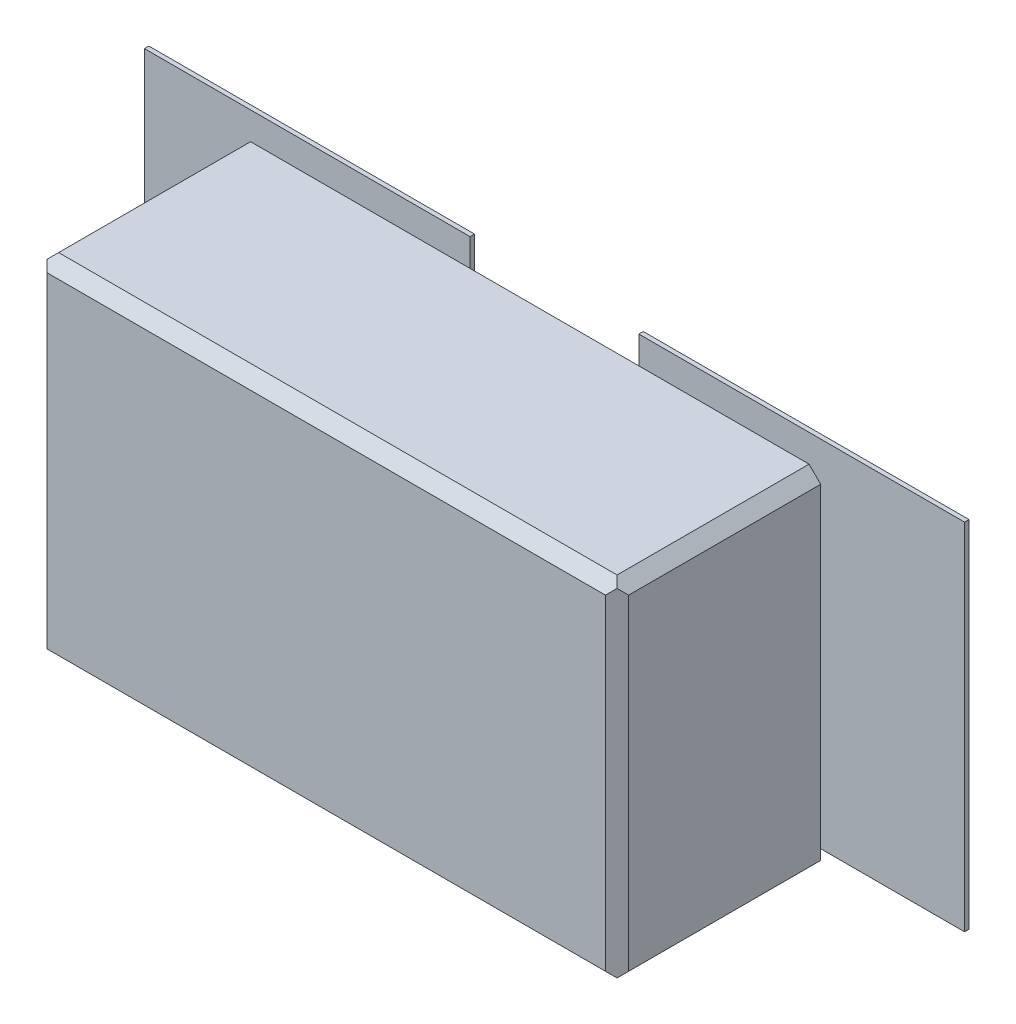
ISO-10303-21;
HEADER;
FILE_DESCRIPTION(('STEP AP214'),'2;1');
FILE_NAME('part.step','',(''),(''),'','','');
FILE_SCHEMA(('AUTOMOTIVE_DESIGN { 1 0 10303 214 1 1 1 1 }'));
ENDSEC;
DATA;
#1=APPLICATION_CONTEXT('core data for automotive mechanical design processes');
#2=APPLICATION_PROTOCOL_DEFINITION('international standard','automotive_design',2000,#1);
#3=PRODUCT_CONTEXT('',#1,'mechanical');
#4=PRODUCT('Part','Part','',(#3));
#5=PRODUCT_RELATED_PRODUCT_CATEGORY('part','',(#4));
#6=PRODUCT_DEFINITION_FORMATION('','',#4);
#7=PRODUCT_DEFINITION_CONTEXT('part definition',#1,'design');
#8=PRODUCT_DEFINITION('design','',#6,#7);
#9=PRODUCT_DEFINITION_SHAPE('','',#8);
#10=(LENGTH_UNIT() NAMED_UNIT(*) SI_UNIT(.MILLI.,.METRE.));
#11=(NAMED_UNIT(*) PLANE_ANGLE_UNIT() SI_UNIT($,.RADIAN.));
#12=(NAMED_UNIT(*) SI_UNIT($,.STERADIAN.) SOLID_ANGLE_UNIT());
#13=UNCERTAINTY_MEASURE_WITH_UNIT(LENGTH_MEASURE(1.E-05),#10,'distance_accuracy_value','');
#14=(GEOMETRIC_REPRESENTATION_CONTEXT(3) GLOBAL_UNCERTAINTY_ASSIGNED_CONTEXT((#13)) GLOBAL_UNIT_ASSIGNED_CONTEXT((#10,
#11,#12)) REPRESENTATION_CONTEXT('',''));
#15=CARTESIAN_POINT('',(0.,0.,0.));
#16=DIRECTION('',(0.,0.,1.));
#17=DIRECTION('',(1.,0.,0.));
#18=AXIS2_PLACEMENT_3D('',#15,#16,#17);
#19=CARTESIAN_POINT('',(0.,0.,0.08382));
#20=DIRECTION('',(0.,0.,1.));
#21=DIRECTION('',(1.,0.,0.));
#22=AXIS2_PLACEMENT_3D('',#19,#20,#21);
#23=PLANE('',#22);
#24=DIRECTION('',(0.,1.,0.));
#25=VECTOR('',#24,1.);
#26=CARTESIAN_POINT('',(0.145000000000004,0.30500000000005,0.08382));
#27=LINE('',#26,#25);
#28=CARTESIAN_POINT('',(0.145000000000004,-0.30500000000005,0.08382));
#29=VERTEX_POINT('',#28);
#30=CARTESIAN_POINT('',(0.145000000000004,0.30500000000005,0.08382));
#31=VERTEX_POINT('',#30);
#32=EDGE_CURVE('P0_E67',#29,#31,#27,.T.);
#33=ORIENTED_EDGE('',*,*,#32,.F.);
#34=DIRECTION('',(1.,0.,0.));
#35=VECTOR('',#34,1.);
#36=CARTESIAN_POINT('',(0.145000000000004,-0.30500000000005,0.08382));
#37=LINE('',#36,#35);
#38=CARTESIAN_POINT('',(0.704999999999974,-0.30500000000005,0.08382));
#39=VERTEX_POINT('',#38);
#40=EDGE_CURVE('P0_E19',#39,#29,#37,.F.);
#41=ORIENTED_EDGE('',*,*,#40,.F.);
#42=DIRECTION('',(0.,1.,0.));
#43=VECTOR('',#42,1.);
#44=CARTESIAN_POINT('',(0.704999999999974,-0.30500000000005,0.08382));
#45=LINE('',#44,#43);
#46=CARTESIAN_POINT('',(0.704999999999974,0.30500000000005,0.08382));
#47=VERTEX_POINT('',#46);
#48=EDGE_CURVE('P0_E57',#47,#39,#45,.F.);
#49=ORIENTED_EDGE('',*,*,#48,.F.);
#50=DIRECTION('',(1.,0.,0.));
#51=VECTOR('',#50,1.);
#52=CARTESIAN_POINT('',(0.704999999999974,0.30500000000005,0.08382));
#53=LINE('',#52,#51);
#54=EDGE_CURVE('P0_E52',#31,#47,#53,.T.);
#55=ORIENTED_EDGE('',*,*,#54,.F.);
#56=EDGE_LOOP('',(#33,#41,#49,#55));
#57=FACE_BOUND('',#56,.T.);
#58=ADVANCED_FACE('P0_F16',(#57),#23,.T.);
#59=CARTESIAN_POINT('',(0.145000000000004,-0.30500000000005,0.0762));
#60=DIRECTION('',(0.,-1.,0.));
#61=DIRECTION('',(0.,0.,-1.));
#62=AXIS2_PLACEMENT_3D('',#59,#60,#61);
#63=PLANE('',#62);
#64=DIRECTION('',(0.,0.,1.));
#65=VECTOR('',#64,1.);
#66=CARTESIAN_POINT('',(0.145000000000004,-0.30500000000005,0.0762));
#67=LINE('',#66,#65);
#68=CARTESIAN_POINT('',(0.145000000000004,-0.30500000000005,0.0762));
#69=VERTEX_POINT('',#68);
#70=EDGE_CURVE('P0_E78',#69,#29,#67,.T.);
#71=ORIENTED_EDGE('',*,*,#70,.F.);
#72=DIRECTION('',(1.,0.,0.));
#73=VECTOR('',#72,1.);
#74=CARTESIAN_POINT('',(0.,-0.30500000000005,0.0762));
#75=LINE('',#74,#73);
#76=CARTESIAN_POINT('',(0.704999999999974,-0.30500000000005,0.0762));
#77=VERTEX_POINT('',#76);
#78=EDGE_CURVE('P0_E73',#69,#77,#75,.T.);
#79=ORIENTED_EDGE('',*,*,#78,.T.);
#80=DIRECTION('',(0.,0.,-1.));
#81=VECTOR('',#80,1.);
#82=CARTESIAN_POINT('',(0.704999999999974,-0.30500000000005,0.0762));
#83=LINE('',#82,#81);
#84=EDGE_CURVE('P0_E62',#39,#77,#83,.T.);
#85=ORIENTED_EDGE('',*,*,#84,.F.);
#86=ORIENTED_EDGE('',*,*,#40,.T.);
#87=EDGE_LOOP('',(#71,#79,#85,#86));
#88=FACE_BOUND('',#87,.T.);
#89=ADVANCED_FACE('P0_F72',(#88),#63,.T.);
#90=CARTESIAN_POINT('',(0.704999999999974,-0.30500000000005,0.0762));
#91=DIRECTION('',(1.,0.,0.));
#92=DIRECTION('',(0.,0.,-1.));
#93=AXIS2_PLACEMENT_3D('',#90,#91,#92);
#94=PLANE('',#93);
#95=ORIENTED_EDGE('',*,*,#84,.T.);
#96=DIRECTION('',(0.,1.,0.));
#97=VECTOR('',#96,1.);
#98=CARTESIAN_POINT('',(0.704999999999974,0.,0.0762));
#99=LINE('',#98,#97);
#100=CARTESIAN_POINT('',(0.704999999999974,0.30500000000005,0.0762));
#101=VERTEX_POINT('',#100);
#102=EDGE_CURVE('P0_E83',#77,#101,#99,.T.);
#103=ORIENTED_EDGE('',*,*,#102,.T.);
#104=DIRECTION('',(0.,0.,1.));
#105=VECTOR('',#104,1.);
#106=CARTESIAN_POINT('',(0.704999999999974,0.30500000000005,0.0762));
#107=LINE('',#106,#105);
#108=EDGE_CURVE('P0_E64',#47,#101,#107,.F.);
#109=ORIENTED_EDGE('',*,*,#108,.F.);
#110=ORIENTED_EDGE('',*,*,#48,.T.);
#111=EDGE_LOOP('',(#95,#103,#109,#110));
#112=FACE_BOUND('',#111,.T.);
#113=ADVANCED_FACE('P0_F59',(#112),#94,.T.);
#114=CARTESIAN_POINT('',(0.704999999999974,0.30500000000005,0.0762));
#115=DIRECTION('',(0.,1.,0.));
#116=DIRECTION('',(0.,0.,1.));
#117=AXIS2_PLACEMENT_3D('',#114,#115,#116);
#118=PLANE('',#117);
#119=ORIENTED_EDGE('',*,*,#108,.T.);
#120=DIRECTION('',(1.,0.,0.));
#121=VECTOR('',#120,1.);
#122=CARTESIAN_POINT('',(0.,0.30500000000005,0.0762));
#123=LINE('',#122,#121);
#124=CARTESIAN_POINT('',(0.145000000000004,0.30500000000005,0.0762));
#125=VERTEX_POINT('',#124);
#126=EDGE_CURVE('P0_E25',#101,#125,#123,.F.);
#127=ORIENTED_EDGE('',*,*,#126,.T.);
#128=DIRECTION('',(0.,0.,1.));
#129=VECTOR('',#128,1.);
#130=CARTESIAN_POINT('',(0.145000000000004,0.30500000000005,0.0762));
#131=LINE('',#130,#129);
#132=EDGE_CURVE('P0_E33',#31,#125,#131,.F.);
#133=ORIENTED_EDGE('',*,*,#132,.F.);
#134=ORIENTED_EDGE('',*,*,#54,.T.);
#135=EDGE_LOOP('',(#119,#127,#133,#134));
#136=FACE_BOUND('',#135,.T.);
#137=ADVANCED_FACE('P0_F87',(#136),#118,.T.);
#138=CARTESIAN_POINT('',(0.145000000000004,0.30500000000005,0.0762));
#139=DIRECTION('',(-1.,0.,0.));
#140=DIRECTION('',(0.,0.,1.));
#141=AXIS2_PLACEMENT_3D('',#138,#139,#140);
#142=PLANE('',#141);
#143=ORIENTED_EDGE('',*,*,#132,.T.);
#144=DIRECTION('',(0.,1.,0.));
#145=VECTOR('',#144,1.);
#146=CARTESIAN_POINT('',(0.145000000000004,0.,0.0762));
#147=LINE('',#146,#145);
#148=EDGE_CURVE('P0_E11',#125,#69,#147,.F.);
#149=ORIENTED_EDGE('',*,*,#148,.T.);
#150=ORIENTED_EDGE('',*,*,#70,.T.);
#151=ORIENTED_EDGE('',*,*,#32,.T.);
#152=EDGE_LOOP('',(#143,#149,#150,#151));
#153=FACE_BOUND('',#152,.T.);
#154=ADVANCED_FACE('P0_F90',(#153),#142,.T.);
#155=CARTESIAN_POINT('',(0.,0.,0.0762));
#156=DIRECTION('',(0.,0.,1.));
#157=DIRECTION('',(1.,0.,0.));
#158=AXIS2_PLACEMENT_3D('',#155,#156,#157);
#159=PLANE('',#158);
#160=ORIENTED_EDGE('',*,*,#126,.F.);
#161=ORIENTED_EDGE('',*,*,#102,.F.);
#162=ORIENTED_EDGE('',*,*,#78,.F.);
#163=ORIENTED_EDGE('',*,*,#148,.F.);
#164=EDGE_LOOP('',(#160,#161,#162,#163));
#165=FACE_BOUND('',#164,.T.);
#166=ADVANCED_FACE('P0_F89',(#165),#159,.F.);
#167=CLOSED_SHELL('',(#58,#89,#113,#137,#154,#166));
#168=MANIFOLD_SOLID_BREP('P0_B1',#167);
#169=CARTESIAN_POINT('',(0.,0.,0.08382));
#170=DIRECTION('',(0.,0.,1.));
#171=DIRECTION('',(1.,0.,0.));
#172=AXIS2_PLACEMENT_3D('',#169,#170,#171);
#173=PLANE('',#172);
#174=DIRECTION('',(0.,1.,0.));
#175=VECTOR('',#174,1.);
#176=CARTESIAN_POINT('',(-0.704999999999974,0.30500000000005,0.08382));
#177=LINE('',#176,#175);
#178=CARTESIAN_POINT('',(-0.704999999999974,-0.30500000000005,0.08382));
#179=VERTEX_POINT('',#178);
#180=CARTESIAN_POINT('',(-0.704999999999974,0.30500000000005,0.08382));
#181=VERTEX_POINT('',#180);
#182=EDGE_CURVE('P1_E67',#179,#181,#177,.T.);
#183=ORIENTED_EDGE('',*,*,#182,.F.);
#184=DIRECTION('',(1.,0.,0.));
#185=VECTOR('',#184,1.);
#186=CARTESIAN_POINT('',(-0.704999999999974,-0.30500000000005,0.08382));
#187=LINE('',#186,#185);
#188=CARTESIAN_POINT('',(-0.145000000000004,-0.30500000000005,0.08382));
#189=VERTEX_POINT('',#188);
#190=EDGE_CURVE('P1_E19',#189,#179,#187,.F.);
#191=ORIENTED_EDGE('',*,*,#190,.F.);
#192=DIRECTION('',(0.,1.,0.));
#193=VECTOR('',#192,1.);
#194=CARTESIAN_POINT('',(-0.145000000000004,-0.30500000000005,0.08382));
#195=LINE('',#194,#193);
#196=CARTESIAN_POINT('',(-0.145000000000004,0.30500000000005,0.08382));
#197=VERTEX_POINT('',#196);
#198=EDGE_CURVE('P1_E57',#197,#189,#195,.F.);
#199=ORIENTED_EDGE('',*,*,#198,.F.);
#200=DIRECTION('',(1.,0.,0.));
#201=VECTOR('',#200,1.);
#202=CARTESIAN_POINT('',(-0.145000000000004,0.30500000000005,0.08382));
#203=LINE('',#202,#201);
#204=EDGE_CURVE('P1_E52',#181,#197,#203,.T.);
#205=ORIENTED_EDGE('',*,*,#204,.F.);
#206=EDGE_LOOP('',(#183,#191,#199,#205));
#207=FACE_BOUND('',#206,.T.);
#208=ADVANCED_FACE('P1_F16',(#207),#173,.T.);
#209=CARTESIAN_POINT('',(-0.704999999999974,-0.30500000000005,0.0762));
#210=DIRECTION('',(0.,-1.,0.));
#211=DIRECTION('',(0.,0.,-1.));
#212=AXIS2_PLACEMENT_3D('',#209,#210,#211);
#213=PLANE('',#212);
#214=DIRECTION('',(0.,0.,1.));
#215=VECTOR('',#214,1.);
#216=CARTESIAN_POINT('',(-0.704999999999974,-0.30500000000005,0.0762));
#217=LINE('',#216,#215);
#218=CARTESIAN_POINT('',(-0.704999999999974,-0.30500000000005,0.0762));
#219=VERTEX_POINT('',#218);
#220=EDGE_CURVE('P1_E78',#219,#179,#217,.T.);
#221=ORIENTED_EDGE('',*,*,#220,.F.);
#222=DIRECTION('',(1.,0.,0.));
#223=VECTOR('',#222,1.);
#224=CARTESIAN_POINT('',(0.,-0.30500000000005,0.0762));
#225=LINE('',#224,#223);
#226=CARTESIAN_POINT('',(-0.145000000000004,-0.30500000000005,0.0762));
#227=VERTEX_POINT('',#226);
#228=EDGE_CURVE('P1_E73',#219,#227,#225,.T.);
#229=ORIENTED_EDGE('',*,*,#228,.T.);
#230=DIRECTION('',(0.,0.,-1.));
#231=VECTOR('',#230,1.);
#232=CARTESIAN_POINT('',(-0.145000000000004,-0.30500000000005,0.0762));
#233=LINE('',#232,#231);
#234=EDGE_CURVE('P1_E62',#189,#227,#233,.T.);
#235=ORIENTED_EDGE('',*,*,#234,.F.);
#236=ORIENTED_EDGE('',*,*,#190,.T.);
#237=EDGE_LOOP('',(#221,#229,#235,#236));
#238=FACE_BOUND('',#237,.T.);
#239=ADVANCED_FACE('P1_F72',(#238),#213,.T.);
#240=CARTESIAN_POINT('',(-0.145000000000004,-0.30500000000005,0.0762));
#241=DIRECTION('',(1.,0.,0.));
#242=DIRECTION('',(0.,0.,-1.));
#243=AXIS2_PLACEMENT_3D('',#240,#241,#242);
#244=PLANE('',#243);
#245=ORIENTED_EDGE('',*,*,#234,.T.);
#246=DIRECTION('',(0.,1.,0.));
#247=VECTOR('',#246,1.);
#248=CARTESIAN_POINT('',(-0.145000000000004,0.,0.0762));
#249=LINE('',#248,#247);
#250=CARTESIAN_POINT('',(-0.145000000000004,0.30500000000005,0.0762));
#251=VERTEX_POINT('',#250);
#252=EDGE_CURVE('P1_E83',#227,#251,#249,.T.);
#253=ORIENTED_EDGE('',*,*,#252,.T.);
#254=DIRECTION('',(0.,0.,1.));
#255=VECTOR('',#254,1.);
#256=CARTESIAN_POINT('',(-0.145000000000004,0.30500000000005,0.0762));
#257=LINE('',#256,#255);
#258=EDGE_CURVE('P1_E64',#197,#251,#257,.F.);
#259=ORIENTED_EDGE('',*,*,#258,.F.);
#260=ORIENTED_EDGE('',*,*,#198,.T.);
#261=EDGE_LOOP('',(#245,#253,#259,#260));
#262=FACE_BOUND('',#261,.T.);
#263=ADVANCED_FACE('P1_F59',(#262),#244,.T.);
#264=CARTESIAN_POINT('',(-0.145000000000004,0.30500000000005,0.0762));
#265=DIRECTION('',(0.,1.,0.));
#266=DIRECTION('',(0.,0.,1.));
#267=AXIS2_PLACEMENT_3D('',#264,#265,#266);
#268=PLANE('',#267);
#269=ORIENTED_EDGE('',*,*,#258,.T.);
#270=DIRECTION('',(1.,0.,0.));
#271=VECTOR('',#270,1.);
#272=CARTESIAN_POINT('',(0.,0.30500000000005,0.0762));
#273=LINE('',#272,#271);
#274=CARTESIAN_POINT('',(-0.704999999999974,0.30500000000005,0.0762));
#275=VERTEX_POINT('',#274);
#276=EDGE_CURVE('P1_E25',#251,#275,#273,.F.);
#277=ORIENTED_EDGE('',*,*,#276,.T.);
#278=DIRECTION('',(0.,0.,1.));
#279=VECTOR('',#278,1.);
#280=CARTESIAN_POINT('',(-0.704999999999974,0.30500000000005,0.0762));
#281=LINE('',#280,#279);
#282=EDGE_CURVE('P1_E33',#181,#275,#281,.F.);
#283=ORIENTED_EDGE('',*,*,#282,.F.);
#284=ORIENTED_EDGE('',*,*,#204,.T.);
#285=EDGE_LOOP('',(#269,#277,#283,#284));
#286=FACE_BOUND('',#285,.T.);
#287=ADVANCED_FACE('P1_F87',(#286),#268,.T.);
#288=CARTESIAN_POINT('',(-0.704999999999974,0.30500000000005,0.0762));
#289=DIRECTION('',(-1.,0.,0.));
#290=DIRECTION('',(0.,0.,1.));
#291=AXIS2_PLACEMENT_3D('',#288,#289,#290);
#292=PLANE('',#291);
#293=ORIENTED_EDGE('',*,*,#282,.T.);
#294=DIRECTION('',(0.,1.,0.));
#295=VECTOR('',#294,1.);
#296=CARTESIAN_POINT('',(-0.704999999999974,0.,0.0762));
#297=LINE('',#296,#295);
#298=EDGE_CURVE('P1_E11',#275,#219,#297,.F.);
#299=ORIENTED_EDGE('',*,*,#298,.T.);
#300=ORIENTED_EDGE('',*,*,#220,.T.);
#301=ORIENTED_EDGE('',*,*,#182,.T.);
#302=EDGE_LOOP('',(#293,#299,#300,#301));
#303=FACE_BOUND('',#302,.T.);
#304=ADVANCED_FACE('P1_F90',(#303),#292,.T.);
#305=CARTESIAN_POINT('',(0.,0.,0.0762));
#306=DIRECTION('',(0.,0.,1.));
#307=DIRECTION('',(1.,0.,0.));
#308=AXIS2_PLACEMENT_3D('',#305,#306,#307);
#309=PLANE('',#308);
#310=ORIENTED_EDGE('',*,*,#276,.F.);
#311=ORIENTED_EDGE('',*,*,#252,.F.);
#312=ORIENTED_EDGE('',*,*,#228,.F.);
#313=ORIENTED_EDGE('',*,*,#298,.F.);
#314=EDGE_LOOP('',(#310,#311,#312,#313));
#315=FACE_BOUND('',#314,.T.);
#316=ADVANCED_FACE('P1_F89',(#315),#309,.F.);
#317=CLOSED_SHELL('',(#208,#239,#263,#287,#304,#316));
#318=MANIFOLD_SOLID_BREP('P1_B1',#317);
#319=CARTESIAN_POINT('',(0.,0.,0.0862000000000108));
#320=DIRECTION('',(0.,0.,-1.));
#321=DIRECTION('',(-1.,0.,0.));
#322=AXIS2_PLACEMENT_3D('',#319,#320,#321);
#323=PLANE('',#322);
#324=DIRECTION('',(1.,0.,0.));
#325=VECTOR('',#324,1.);
#326=CARTESIAN_POINT('',(-0.415997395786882,0.249999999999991,0.0862000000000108));
#327=LINE('',#326,#325);
#328=CARTESIAN_POINT('',(-0.215997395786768,0.249999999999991,0.0862000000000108));
#329=VERTEX_POINT('',#328);
#330=CARTESIAN_POINT('',(-0.41599739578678,0.249999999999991,0.0862000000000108));
#331=VERTEX_POINT('',#330);
#332=EDGE_CURVE('P2_E183',#329,#331,#327,.F.);
#333=ORIENTED_EDGE('',*,*,#332,.F.);
#334=DIRECTION('',(0.,1.,0.));
#335=VECTOR('',#334,1.);
#336=CARTESIAN_POINT('',(-0.215997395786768,0.249999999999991,0.0862000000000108));
#337=LINE('',#336,#335);
#338=CARTESIAN_POINT('',(-0.215997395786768,-0.249999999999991,0.0862000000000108));
#339=VERTEX_POINT('',#338);
#340=EDGE_CURVE('P2_E211',#339,#329,#337,.T.);
#341=ORIENTED_EDGE('',*,*,#340,.F.);
#342=DIRECTION('',(1.,0.,0.));
#343=VECTOR('',#342,1.);
#344=CARTESIAN_POINT('',(-0.215997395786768,-0.249999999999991,0.0862000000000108));
#345=LINE('',#344,#343);
#346=CARTESIAN_POINT('',(-0.465997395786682,-0.249999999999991,0.0862000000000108));
#347=VERTEX_POINT('',#346);
#348=EDGE_CURVE('P2_E162',#347,#339,#345,.T.);
#349=ORIENTED_EDGE('',*,*,#348,.F.);
#350=DIRECTION('',(0.,1.,0.));
#351=VECTOR('',#350,1.);
#352=CARTESIAN_POINT('',(-0.465997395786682,-0.249999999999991,0.0862000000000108));
#353=LINE('',#352,#351);
#354=CARTESIAN_POINT('',(-0.465997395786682,0.199999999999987,0.0862000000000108));
#355=VERTEX_POINT('',#354);
#356=EDGE_CURVE('P2_E156',#355,#347,#353,.F.);
#357=ORIENTED_EDGE('',*,*,#356,.F.);
#358=CARTESIAN_POINT('',(-0.465997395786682,0.249999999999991,0.0862000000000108));
#359=DIRECTION('',(0.,0.,-1.));
#360=DIRECTION('',(-1.,0.,0.));
#361=AXIS2_PLACEMENT_3D('',#358,#359,#360);
#362=CIRCLE('',#361,0.0500000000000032);
#363=EDGE_CURVE('P2_E19',#355,#331,#362,.F.);
#364=ORIENTED_EDGE('',*,*,#363,.T.);
#365=EDGE_LOOP('',(#333,#341,#349,#357,#364));
#366=FACE_BOUND('',#365,.T.);
#367=ADVANCED_FACE('P2_F16',(#366),#323,.T.);
#368=CARTESIAN_POINT('',(0.,0.,0.0862000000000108));
#369=DIRECTION('',(0.,0.,-1.));
#370=DIRECTION('',(-1.,0.,0.));
#371=AXIS2_PLACEMENT_3D('',#368,#369,#370);
#372=PLANE('',#371);
#373=DIRECTION('',(1.,0.,0.));
#374=VECTOR('',#373,1.);
#375=CARTESIAN_POINT('',(0.184002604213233,0.249999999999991,0.0862000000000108));
#376=LINE('',#375,#374);
#377=CARTESIAN_POINT('',(0.434002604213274,0.249999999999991,0.0862000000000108));
#378=VERTEX_POINT('',#377);
#379=CARTESIAN_POINT('',(0.184002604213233,0.249999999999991,0.0862000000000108));
#380=VERTEX_POINT('',#379);
#381=EDGE_CURVE('P2_E231',#378,#380,#376,.F.);
#382=ORIENTED_EDGE('',*,*,#381,.F.);
#383=DIRECTION('',(0.,1.,0.));
#384=VECTOR('',#383,1.);
#385=CARTESIAN_POINT('',(0.434002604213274,0.249999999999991,0.0862000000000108));
#386=LINE('',#385,#384);
#387=CARTESIAN_POINT('',(0.434002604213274,-0.249999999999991,0.0862000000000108));
#388=VERTEX_POINT('',#387);
#389=EDGE_CURVE('P2_E248',#388,#378,#386,.T.);
#390=ORIENTED_EDGE('',*,*,#389,.F.);
#391=DIRECTION('',(1.,0.,0.));
#392=VECTOR('',#391,1.);
#393=CARTESIAN_POINT('',(0.434002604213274,-0.249999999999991,0.0862000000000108));
#394=LINE('',#393,#392);
#395=CARTESIAN_POINT('',(0.184002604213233,-0.249999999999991,0.0862000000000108));
#396=VERTEX_POINT('',#395);
#397=EDGE_CURVE('P2_E246',#396,#388,#394,.T.);
#398=ORIENTED_EDGE('',*,*,#397,.F.);
#399=DIRECTION('',(0.,1.,0.));
#400=VECTOR('',#399,1.);
#401=CARTESIAN_POINT('',(0.184002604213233,-0.249999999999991,0.0862000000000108));
#402=LINE('',#401,#400);
#403=EDGE_CURVE('P2_E240',#380,#396,#402,.F.);
#404=ORIENTED_EDGE('',*,*,#403,.F.);
#405=EDGE_LOOP('',(#382,#390,#398,#404));
#406=FACE_BOUND('',#405,.T.);
#407=ADVANCED_FACE('P2_F272',(#406),#372,.T.);
#408=CARTESIAN_POINT('',(-0.215997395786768,0.249999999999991,0.126200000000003));
#409=DIRECTION('',(1.,0.,0.));
#410=DIRECTION('',(0.,0.,-1.));
#411=AXIS2_PLACEMENT_3D('',#408,#409,#410);
#412=PLANE('',#411);
#413=DIRECTION('',(0.,0.,1.));
#414=VECTOR('',#413,1.);
#415=CARTESIAN_POINT('',(-0.215997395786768,0.249999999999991,0.126200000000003));
#416=LINE('',#415,#414);
#417=CARTESIAN_POINT('',(-0.215997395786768,0.249999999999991,0.126200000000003));
#418=VERTEX_POINT('',#417);
#419=EDGE_CURVE('P2_E181',#418,#329,#416,.F.);
#420=ORIENTED_EDGE('',*,*,#419,.F.);
#421=DIRECTION('',(0.,1.,0.));
#422=VECTOR('',#421,1.);
#423=CARTESIAN_POINT('',(-0.215997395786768,0.,0.126200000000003));
#424=LINE('',#423,#422);
#425=CARTESIAN_POINT('',(-0.215997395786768,-0.249999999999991,0.126200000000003));
#426=VERTEX_POINT('',#425);
#427=EDGE_CURVE('P2_E193',#418,#426,#424,.F.);
#428=ORIENTED_EDGE('',*,*,#427,.T.);
#429=DIRECTION('',(0.,0.,-1.));
#430=VECTOR('',#429,1.);
#431=CARTESIAN_POINT('',(-0.215997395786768,-0.249999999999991,0.126200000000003));
#432=LINE('',#431,#430);
#433=EDGE_CURVE('P2_E167',#339,#426,#432,.F.);
#434=ORIENTED_EDGE('',*,*,#433,.F.);
#435=ORIENTED_EDGE('',*,*,#340,.T.);
#436=EDGE_LOOP('',(#420,#428,#434,#435));
#437=FACE_BOUND('',#436,.T.);
#438=ADVANCED_FACE('P2_F261',(#437),#412,.T.);
#439=CARTESIAN_POINT('',(-0.215997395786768,-0.249999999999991,0.126200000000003));
#440=DIRECTION('',(0.,-1.,0.));
#441=DIRECTION('',(0.,0.,-1.));
#442=AXIS2_PLACEMENT_3D('',#439,#440,#441);
#443=PLANE('',#442);
#444=ORIENTED_EDGE('',*,*,#433,.T.);
#445=DIRECTION('',(1.,0.,0.));
#446=VECTOR('',#445,1.);
#447=CARTESIAN_POINT('',(0.,-0.249999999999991,0.126200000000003));
#448=LINE('',#447,#446);
#449=CARTESIAN_POINT('',(-0.465997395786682,-0.249999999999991,0.126200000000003));
#450=VERTEX_POINT('',#449);
#451=EDGE_CURVE('P2_E195',#426,#450,#448,.F.);
#452=ORIENTED_EDGE('',*,*,#451,.T.);
#453=DIRECTION('',(0.,0.,1.));
#454=VECTOR('',#453,1.);
#455=CARTESIAN_POINT('',(-0.465997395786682,-0.249999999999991,0.126200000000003));
#456=LINE('',#455,#454);
#457=EDGE_CURVE('P2_E166',#347,#450,#456,.T.);
#458=ORIENTED_EDGE('',*,*,#457,.F.);
#459=ORIENTED_EDGE('',*,*,#348,.T.);
#460=EDGE_LOOP('',(#444,#452,#458,#459));
#461=FACE_BOUND('',#460,.T.);
#462=ADVANCED_FACE('P2_F263',(#461),#443,.T.);
#463=CARTESIAN_POINT('',(-0.465997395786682,-0.249999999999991,0.126200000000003));
#464=DIRECTION('',(-1.,0.,0.));
#465=DIRECTION('',(0.,0.,1.));
#466=AXIS2_PLACEMENT_3D('',#463,#464,#465);
#467=PLANE('',#466);
#468=ORIENTED_EDGE('',*,*,#457,.T.);
#469=DIRECTION('',(0.,1.,0.));
#470=VECTOR('',#469,1.);
#471=CARTESIAN_POINT('',(-0.465997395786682,0.,0.126200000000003));
#472=LINE('',#471,#470);
#473=CARTESIAN_POINT('',(-0.465997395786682,0.199999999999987,0.126200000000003));
#474=VERTEX_POINT('',#473);
#475=EDGE_CURVE('P2_E173',#450,#474,#472,.T.);
#476=ORIENTED_EDGE('',*,*,#475,.T.);
#477=DIRECTION('',(0.,0.,-1.));
#478=VECTOR('',#477,1.);
#479=CARTESIAN_POINT('',(-0.465997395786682,0.199999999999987,0.126200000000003));
#480=LINE('',#479,#478);
#481=EDGE_CURVE('P2_E170',#474,#355,#480,.T.);
#482=ORIENTED_EDGE('',*,*,#481,.T.);
#483=ORIENTED_EDGE('',*,*,#356,.T.);
#484=EDGE_LOOP('',(#468,#476,#482,#483));
#485=FACE_BOUND('',#484,.T.);
#486=ADVANCED_FACE('P2_F171',(#485),#467,.T.);
#487=CARTESIAN_POINT('',(-0.465997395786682,0.249999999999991,0.126200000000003));
#488=DIRECTION('',(0.,0.,-1.));
#489=DIRECTION('',(-1.,0.,0.));
#490=AXIS2_PLACEMENT_3D('',#487,#488,#489);
#491=CYLINDRICAL_SURFACE('',#490,0.0500000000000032);
#492=ORIENTED_EDGE('',*,*,#363,.F.);
#493=ORIENTED_EDGE('',*,*,#481,.F.);
#494=CARTESIAN_POINT('',(-0.465997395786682,0.249999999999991,0.126200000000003));
#495=DIRECTION('',(0.,0.,-1.));
#496=DIRECTION('',(-1.,0.,0.));
#497=AXIS2_PLACEMENT_3D('',#494,#495,#496);
#498=CIRCLE('',#497,0.0500000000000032);
#499=CARTESIAN_POINT('',(-0.41599739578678,0.249999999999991,0.126200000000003));
#500=VERTEX_POINT('',#499);
#501=EDGE_CURVE('P2_E219',#474,#500,#498,.F.);
#502=ORIENTED_EDGE('',*,*,#501,.T.);
#503=DIRECTION('',(0.,0.,1.));
#504=VECTOR('',#503,1.);
#505=CARTESIAN_POINT('',(-0.415997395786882,0.249999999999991,0.126200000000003));
#506=LINE('',#505,#504);
#507=EDGE_CURVE('P2_E179',#331,#500,#506,.T.);
#508=ORIENTED_EDGE('',*,*,#507,.F.);
#509=EDGE_LOOP('',(#492,#493,#502,#508));
#510=FACE_BOUND('',#509,.T.);
#511=ADVANCED_FACE('P2_F177',(#510),#491,.F.);
#512=CARTESIAN_POINT('',(-0.415997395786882,0.249999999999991,0.126200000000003));
#513=DIRECTION('',(0.,1.,0.));
#514=DIRECTION('',(0.,0.,1.));
#515=AXIS2_PLACEMENT_3D('',#512,#513,#514);
#516=PLANE('',#515);
#517=ORIENTED_EDGE('',*,*,#507,.T.);
#518=DIRECTION('',(1.,0.,0.));
#519=VECTOR('',#518,1.);
#520=CARTESIAN_POINT('',(0.,0.249999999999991,0.126200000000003));
#521=LINE('',#520,#519);
#522=EDGE_CURVE('P2_E220',#500,#418,#521,.T.);
#523=ORIENTED_EDGE('',*,*,#522,.T.);
#524=ORIENTED_EDGE('',*,*,#419,.T.);
#525=ORIENTED_EDGE('',*,*,#332,.T.);
#526=EDGE_LOOP('',(#517,#523,#524,#525));
#527=FACE_BOUND('',#526,.T.);
#528=ADVANCED_FACE('P2_F253',(#527),#516,.T.);
#529=CARTESIAN_POINT('',(0.434002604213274,0.249999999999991,0.126200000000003));
#530=DIRECTION('',(1.,0.,0.));
#531=DIRECTION('',(0.,0.,-1.));
#532=AXIS2_PLACEMENT_3D('',#529,#530,#531);
#533=PLANE('',#532);
#534=DIRECTION('',(0.,0.,1.));
#535=VECTOR('',#534,1.);
#536=CARTESIAN_POINT('',(0.434002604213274,0.249999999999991,0.126200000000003));
#537=LINE('',#536,#535);
#538=CARTESIAN_POINT('',(0.434002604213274,0.249999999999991,0.126200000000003));
#539=VERTEX_POINT('',#538);
#540=EDGE_CURVE('P2_E234',#539,#378,#537,.F.);
#541=ORIENTED_EDGE('',*,*,#540,.F.);
#542=DIRECTION('',(0.,1.,0.));
#543=VECTOR('',#542,1.);
#544=CARTESIAN_POINT('',(0.434002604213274,0.,0.126200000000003));
#545=LINE('',#544,#543);
#546=CARTESIAN_POINT('',(0.434002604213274,-0.249999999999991,0.126200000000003));
#547=VERTEX_POINT('',#546);
#548=EDGE_CURVE('P2_E221',#539,#547,#545,.F.);
#549=ORIENTED_EDGE('',*,*,#548,.T.);
#550=DIRECTION('',(0.,0.,-1.));
#551=VECTOR('',#550,1.);
#552=CARTESIAN_POINT('',(0.434002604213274,-0.249999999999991,0.126200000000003));
#553=LINE('',#552,#551);
#554=EDGE_CURVE('P2_E243',#388,#547,#553,.F.);
#555=ORIENTED_EDGE('',*,*,#554,.F.);
#556=ORIENTED_EDGE('',*,*,#389,.T.);
#557=EDGE_LOOP('',(#541,#549,#555,#556));
#558=FACE_BOUND('',#557,.T.);
#559=ADVANCED_FACE('P2_F343',(#558),#533,.T.);
#560=CARTESIAN_POINT('',(0.434002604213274,-0.249999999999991,0.126200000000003));
#561=DIRECTION('',(0.,-1.,0.));
#562=DIRECTION('',(0.,0.,-1.));
#563=AXIS2_PLACEMENT_3D('',#560,#561,#562);
#564=PLANE('',#563);
#565=ORIENTED_EDGE('',*,*,#554,.T.);
#566=DIRECTION('',(1.,0.,0.));
#567=VECTOR('',#566,1.);
#568=CARTESIAN_POINT('',(0.,-0.249999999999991,0.126200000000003));
#569=LINE('',#568,#567);
#570=CARTESIAN_POINT('',(0.184002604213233,-0.249999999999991,0.126200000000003));
#571=VERTEX_POINT('',#570);
#572=EDGE_CURVE('P2_E512',#547,#571,#569,.F.);
#573=ORIENTED_EDGE('',*,*,#572,.T.);
#574=DIRECTION('',(0.,0.,1.));
#575=VECTOR('',#574,1.);
#576=CARTESIAN_POINT('',(0.184002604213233,-0.249999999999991,0.126200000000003));
#577=LINE('',#576,#575);
#578=EDGE_CURVE('P2_E237',#396,#571,#577,.T.);
#579=ORIENTED_EDGE('',*,*,#578,.F.);
#580=ORIENTED_EDGE('',*,*,#397,.T.);
#581=EDGE_LOOP('',(#565,#573,#579,#580));
#582=FACE_BOUND('',#581,.T.);
#583=ADVANCED_FACE('P2_F339',(#582),#564,.T.);
#584=CARTESIAN_POINT('',(0.184002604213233,-0.249999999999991,0.126200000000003));
#585=DIRECTION('',(-1.,0.,0.));
#586=DIRECTION('',(0.,0.,1.));
#587=AXIS2_PLACEMENT_3D('',#584,#585,#586);
#588=PLANE('',#587);
#589=ORIENTED_EDGE('',*,*,#578,.T.);
#590=DIRECTION('',(0.,1.,0.));
#591=VECTOR('',#590,1.);
#592=CARTESIAN_POINT('',(0.184002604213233,0.,0.126200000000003));
#593=LINE('',#592,#591);
#594=CARTESIAN_POINT('',(0.184002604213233,0.249999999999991,0.126200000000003));
#595=VERTEX_POINT('',#594);
#596=EDGE_CURVE('P2_E516',#571,#595,#593,.T.);
#597=ORIENTED_EDGE('',*,*,#596,.T.);
#598=DIRECTION('',(0.,0.,1.));
#599=VECTOR('',#598,1.);
#600=CARTESIAN_POINT('',(0.184002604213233,0.249999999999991,0.126200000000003));
#601=LINE('',#600,#599);
#602=EDGE_CURVE('P2_E196',#380,#595,#601,.T.);
#603=ORIENTED_EDGE('',*,*,#602,.F.);
#604=ORIENTED_EDGE('',*,*,#403,.T.);
#605=EDGE_LOOP('',(#589,#597,#603,#604));
#606=FACE_BOUND('',#605,.T.);
#607=ADVANCED_FACE('P2_F335',(#606),#588,.T.);
#608=CARTESIAN_POINT('',(0.184002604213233,0.249999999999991,0.126200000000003));
#609=DIRECTION('',(0.,1.,0.));
#610=DIRECTION('',(0.,0.,1.));
#611=AXIS2_PLACEMENT_3D('',#608,#609,#610);
#612=PLANE('',#611);
#613=ORIENTED_EDGE('',*,*,#602,.T.);
#614=DIRECTION('',(1.,0.,0.));
#615=VECTOR('',#614,1.);
#616=CARTESIAN_POINT('',(0.,0.249999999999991,0.126200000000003));
#617=LINE('',#616,#615);
#618=EDGE_CURVE('P2_E509',#595,#539,#617,.T.);
#619=ORIENTED_EDGE('',*,*,#618,.T.);
#620=ORIENTED_EDGE('',*,*,#540,.T.);
#621=ORIENTED_EDGE('',*,*,#381,.T.);
#622=EDGE_LOOP('',(#613,#619,#620,#621));
#623=FACE_BOUND('',#622,.T.);
#624=ADVANCED_FACE('P2_F331',(#623),#612,.T.);
#625=CARTESIAN_POINT('',(0.,0.,0.126200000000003));
#626=DIRECTION('',(0.,0.,1.));
#627=DIRECTION('',(1.,0.,0.));
#628=AXIS2_PLACEMENT_3D('',#625,#626,#627);
#629=PLANE('',#628);
#630=ORIENTED_EDGE('',*,*,#596,.F.);
#631=ORIENTED_EDGE('',*,*,#572,.F.);
#632=ORIENTED_EDGE('',*,*,#548,.F.);
#633=ORIENTED_EDGE('',*,*,#618,.F.);
#634=EDGE_LOOP('',(#630,#631,#632,#633));
#635=FACE_BOUND('',#634,.T.);
#636=ORIENTED_EDGE('',*,*,#501,.F.);
#637=ORIENTED_EDGE('',*,*,#475,.F.);
#638=ORIENTED_EDGE('',*,*,#451,.F.);
#639=ORIENTED_EDGE('',*,*,#427,.F.);
#640=ORIENTED_EDGE('',*,*,#522,.F.);
#641=EDGE_LOOP('',(#636,#637,#638,#639,#640));
#642=FACE_BOUND('',#641,.T.);
#643=DIRECTION('',(0.707106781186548,0.707106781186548,0.));
#644=VECTOR('',#643,1.);
#645=CARTESIAN_POINT('',(0.490000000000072,-0.29000000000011,0.126200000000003));
#646=LINE('',#645,#644);
#647=CARTESIAN_POINT('',(0.480000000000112,-0.30000000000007,0.126200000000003));
#648=VERTEX_POINT('',#647);
#649=CARTESIAN_POINT('',(0.500000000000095,-0.27999999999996,0.126200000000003));
#650=VERTEX_POINT('',#649);
#651=EDGE_CURVE('P2_E551',#648,#650,#646,.T.);
#652=ORIENTED_EDGE('',*,*,#651,.F.);
#653=DIRECTION('',(1.,0.,0.));
#654=VECTOR('',#653,1.);
#655=CARTESIAN_POINT('',(-0.500000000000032,-0.30000000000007,0.126200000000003));
#656=LINE('',#655,#654);
#657=CARTESIAN_POINT('',(-0.480000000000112,-0.30000000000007,0.126200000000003));
#658=VERTEX_POINT('',#657);
#659=EDGE_CURVE('P2_E541',#658,#648,#656,.T.);
#660=ORIENTED_EDGE('',*,*,#659,.F.);
#661=DIRECTION('',(0.707106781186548,-0.707106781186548,0.));
#662=VECTOR('',#661,1.);
#663=CARTESIAN_POINT('',(-0.490000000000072,-0.29000000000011,0.126200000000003));
#664=LINE('',#663,#662);
#665=CARTESIAN_POINT('',(-0.500000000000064,-0.279999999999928,0.126200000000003));
#666=VERTEX_POINT('',#665);
#667=EDGE_CURVE('P2_E536',#666,#658,#664,.T.);
#668=ORIENTED_EDGE('',*,*,#667,.F.);
#669=DIRECTION('',(0.,1.,0.));
#670=VECTOR('',#669,1.);
#671=CARTESIAN_POINT('',(-0.500000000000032,0.30000000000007,0.126200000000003));
#672=LINE('',#671,#670);
#673=CARTESIAN_POINT('',(-0.500000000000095,0.27999999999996,0.126200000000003));
#674=VERTEX_POINT('',#673);
#675=EDGE_CURVE('P2_E531',#674,#666,#672,.F.);
#676=ORIENTED_EDGE('',*,*,#675,.F.);
#677=DIRECTION('',(-0.707106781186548,-0.707106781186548,0.));
#678=VECTOR('',#677,1.);
#679=CARTESIAN_POINT('',(-0.490000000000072,0.29000000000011,0.126200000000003));
#680=LINE('',#679,#678);
#681=CARTESIAN_POINT('',(-0.480000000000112,0.30000000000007,0.126200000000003));
#682=VERTEX_POINT('',#681);
#683=EDGE_CURVE('P2_E526',#682,#674,#680,.T.);
#684=ORIENTED_EDGE('',*,*,#683,.F.);
#685=DIRECTION('',(1.,0.,0.));
#686=VECTOR('',#685,1.);
#687=CARTESIAN_POINT('',(0.500000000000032,0.30000000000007,0.126200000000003));
#688=LINE('',#687,#686);
#689=CARTESIAN_POINT('',(0.480000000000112,0.30000000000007,0.126200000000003));
#690=VERTEX_POINT('',#689);
#691=EDGE_CURVE('P2_E521',#690,#682,#688,.F.);
#692=ORIENTED_EDGE('',*,*,#691,.F.);
#693=DIRECTION('',(-0.707106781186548,0.707106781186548,0.));
#694=VECTOR('',#693,1.);
#695=CARTESIAN_POINT('',(0.490000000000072,0.29000000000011,0.126200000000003));
#696=LINE('',#695,#694);
#697=CARTESIAN_POINT('',(0.500000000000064,0.279999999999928,0.126200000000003));
#698=VERTEX_POINT('',#697);
#699=EDGE_CURVE('P2_E545',#698,#690,#696,.T.);
#700=ORIENTED_EDGE('',*,*,#699,.F.);
#701=DIRECTION('',(0.,1.,0.));
#702=VECTOR('',#701,1.);
#703=CARTESIAN_POINT('',(0.500000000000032,-0.30000000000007,0.126200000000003));
#704=LINE('',#703,#702);
#705=EDGE_CURVE('P2_E556',#650,#698,#704,.T.);
#706=ORIENTED_EDGE('',*,*,#705,.F.);
#707=EDGE_LOOP('',(#652,#660,#668,#676,#684,#692,#700,#706));
#708=FACE_BOUND('',#707,.T.);
#709=ADVANCED_FACE('P2_F256',(#635,#642,#708),#629,.F.);
#710=CARTESIAN_POINT('',(0.500000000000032,0.30000000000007,0.0762));
#711=DIRECTION('',(0.,1.,0.));
#712=DIRECTION('',(0.,0.,1.));
#713=AXIS2_PLACEMENT_3D('',#710,#711,#712);
#714=PLANE('',#713);
#715=DIRECTION('',(1.,0.,0.));
#716=VECTOR('',#715,1.);
#717=CARTESIAN_POINT('',(0.,0.30000000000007,0.45625000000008));
#718=LINE('',#717,#716);
#719=CARTESIAN_POINT('',(0.480000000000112,0.30000000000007,0.45625000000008));
#720=VERTEX_POINT('',#719);
#721=CARTESIAN_POINT('',(-0.480000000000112,0.30000000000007,0.45625000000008));
#722=VERTEX_POINT('',#721);
#723=EDGE_CURVE('P2_E565',#720,#722,#718,.F.);
#724=ORIENTED_EDGE('',*,*,#723,.F.);
#725=DIRECTION('',(0.,0.,1.));
#726=VECTOR('',#725,1.);
#727=CARTESIAN_POINT('',(0.480000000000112,0.30000000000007,0.3012249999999));
#728=LINE('',#727,#726);
#729=EDGE_CURVE('P2_E543',#690,#720,#728,.T.);
#730=ORIENTED_EDGE('',*,*,#729,.F.);
#731=ORIENTED_EDGE('',*,*,#691,.T.);
#732=DIRECTION('',(0.,0.,1.));
#733=VECTOR('',#732,1.);
#734=CARTESIAN_POINT('',(-0.480000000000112,0.30000000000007,0.3012249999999));
#735=LINE('',#734,#733);
#736=EDGE_CURVE('P2_E523',#722,#682,#735,.F.);
#737=ORIENTED_EDGE('',*,*,#736,.F.);
#738=EDGE_LOOP('',(#724,#730,#731,#737));
#739=FACE_BOUND('',#738,.T.);
#740=ADVANCED_FACE('P2_F324',(#739),#714,.T.);
#741=CARTESIAN_POINT('',(-0.490000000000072,0.29000000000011,0.3012249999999));
#742=DIRECTION('',(-0.707106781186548,0.707106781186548,0.));
#743=DIRECTION('',(-0.707106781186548,-0.707106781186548,0.));
#744=AXIS2_PLACEMENT_3D('',#741,#742,#743);
#745=PLANE('',#744);
#746=ORIENTED_EDGE('',*,*,#736,.T.);
#747=ORIENTED_EDGE('',*,*,#683,.T.);
#748=DIRECTION('',(0.,0.,1.));
#749=VECTOR('',#748,1.);
#750=CARTESIAN_POINT('',(-0.500000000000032,0.279999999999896,0.0762));
#751=LINE('',#750,#749);
#752=CARTESIAN_POINT('',(-0.500000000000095,0.27999999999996,0.45625000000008));
#753=VERTEX_POINT('',#752);
#754=EDGE_CURVE('P2_E528',#753,#674,#751,.F.);
#755=ORIENTED_EDGE('',*,*,#754,.F.);
#756=DIRECTION('',(-0.577350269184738,-0.577350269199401,-0.577350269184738));
#757=VECTOR('',#756,1.);
#758=CARTESIAN_POINT('',(-0.490000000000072,0.29000000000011,0.46625000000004));
#759=LINE('',#758,#757);
#760=CARTESIAN_POINT('',(-0.490000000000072,0.29000000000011,0.46625000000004));
#761=VERTEX_POINT('',#760);
#762=EDGE_CURVE('P2_E575',#761,#753,#759,.T.);
#763=ORIENTED_EDGE('',*,*,#762,.F.);
#764=DIRECTION('',(-0.577350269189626,-0.577350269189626,0.577350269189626));
#765=VECTOR('',#764,1.);
#766=CARTESIAN_POINT('',(-0.480000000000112,0.30000000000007,0.45625000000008));
#767=LINE('',#766,#765);
#768=EDGE_CURVE('P2_E568',#722,#761,#767,.T.);
#769=ORIENTED_EDGE('',*,*,#768,.F.);
#770=EDGE_LOOP('',(#746,#747,#755,#763,#769));
#771=FACE_BOUND('',#770,.T.);
#772=ADVANCED_FACE('P2_F320',(#771),#745,.T.);
#773=CARTESIAN_POINT('',(-0.500000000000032,0.30000000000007,0.0762));
#774=DIRECTION('',(-1.,0.,0.));
#775=DIRECTION('',(0.,0.,1.));
#776=AXIS2_PLACEMENT_3D('',#773,#774,#775);
#777=PLANE('',#776);
#778=ORIENTED_EDGE('',*,*,#675,.T.);
#779=DIRECTION('',(0.,0.,1.));
#780=VECTOR('',#779,1.);
#781=CARTESIAN_POINT('',(-0.500000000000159,-0.280000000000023,0.3012249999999));
#782=LINE('',#781,#780);
#783=CARTESIAN_POINT('',(-0.500000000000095,-0.27999999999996,0.45625000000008));
#784=VERTEX_POINT('',#783);
#785=EDGE_CURVE('P2_E533',#784,#666,#782,.F.);
#786=ORIENTED_EDGE('',*,*,#785,.F.);
#787=DIRECTION('',(0.,1.,0.));
#788=VECTOR('',#787,1.);
#789=CARTESIAN_POINT('',(-0.500000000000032,0.,0.45625000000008));
#790=LINE('',#789,#788);
#791=EDGE_CURVE('P2_E578',#753,#784,#790,.F.);
#792=ORIENTED_EDGE('',*,*,#791,.F.);
#793=ORIENTED_EDGE('',*,*,#754,.T.);
#794=EDGE_LOOP('',(#778,#786,#792,#793));
#795=FACE_BOUND('',#794,.T.);
#796=ADVANCED_FACE('P2_F316',(#795),#777,.T.);
#797=CARTESIAN_POINT('',(-0.490000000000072,-0.29000000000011,0.3012249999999));
#798=DIRECTION('',(-0.707106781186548,-0.707106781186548,0.));
#799=DIRECTION('',(0.707106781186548,-0.707106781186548,0.));
#800=AXIS2_PLACEMENT_3D('',#797,#798,#799);
#801=PLANE('',#800);
#802=ORIENTED_EDGE('',*,*,#785,.T.);
#803=ORIENTED_EDGE('',*,*,#667,.T.);
#804=DIRECTION('',(0.,0.,-1.));
#805=VECTOR('',#804,1.);
#806=CARTESIAN_POINT('',(-0.480000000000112,-0.30000000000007,0.0762));
#807=LINE('',#806,#805);
#808=CARTESIAN_POINT('',(-0.480000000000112,-0.30000000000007,0.45625000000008));
#809=VERTEX_POINT('',#808);
#810=EDGE_CURVE('P2_E538',#809,#658,#807,.T.);
#811=ORIENTED_EDGE('',*,*,#810,.F.);
#812=DIRECTION('',(0.577350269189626,-0.577350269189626,-0.577350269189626));
#813=VECTOR('',#812,1.);
#814=CARTESIAN_POINT('',(-0.490000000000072,-0.29000000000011,0.46625000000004));
#815=LINE('',#814,#813);
#816=CARTESIAN_POINT('',(-0.490000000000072,-0.29000000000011,0.46625000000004));
#817=VERTEX_POINT('',#816);
#818=EDGE_CURVE('P2_E586',#817,#809,#815,.T.);
#819=ORIENTED_EDGE('',*,*,#818,.F.);
#820=DIRECTION('',(0.577350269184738,-0.577350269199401,0.577350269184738));
#821=VECTOR('',#820,1.);
#822=CARTESIAN_POINT('',(-0.500000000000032,-0.279999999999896,0.45625000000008));
#823=LINE('',#822,#821);
#824=EDGE_CURVE('P2_E570',#784,#817,#823,.T.);
#825=ORIENTED_EDGE('',*,*,#824,.F.);
#826=EDGE_LOOP('',(#802,#803,#811,#819,#825));
#827=FACE_BOUND('',#826,.T.);
#828=ADVANCED_FACE('P2_F312',(#827),#801,.T.);
#829=CARTESIAN_POINT('',(-0.500000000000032,-0.30000000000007,0.0762));
#830=DIRECTION('',(0.,-1.,0.));
#831=DIRECTION('',(0.,0.,-1.));
#832=AXIS2_PLACEMENT_3D('',#829,#830,#831);
#833=PLANE('',#832);
#834=ORIENTED_EDGE('',*,*,#659,.T.);
#835=DIRECTION('',(0.,0.,1.));
#836=VECTOR('',#835,1.);
#837=CARTESIAN_POINT('',(0.480000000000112,-0.30000000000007,0.3012249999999));
#838=LINE('',#837,#836);
#839=CARTESIAN_POINT('',(0.480000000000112,-0.30000000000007,0.45625000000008));
#840=VERTEX_POINT('',#839);
#841=EDGE_CURVE('P2_E548',#840,#648,#838,.F.);
#842=ORIENTED_EDGE('',*,*,#841,.F.);
#843=DIRECTION('',(1.,0.,0.));
#844=VECTOR('',#843,1.);
#845=CARTESIAN_POINT('',(0.,-0.30000000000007,0.45625000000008));
#846=LINE('',#845,#844);
#847=EDGE_CURVE('P2_E589',#809,#840,#846,.T.);
#848=ORIENTED_EDGE('',*,*,#847,.F.);
#849=ORIENTED_EDGE('',*,*,#810,.T.);
#850=EDGE_LOOP('',(#834,#842,#848,#849));
#851=FACE_BOUND('',#850,.T.);
#852=ADVANCED_FACE('P2_F308',(#851),#833,.T.);
#853=CARTESIAN_POINT('',(0.490000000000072,0.29000000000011,0.3012249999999));
#854=DIRECTION('',(0.707106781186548,0.707106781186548,0.));
#855=DIRECTION('',(-0.707106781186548,0.707106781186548,0.));
#856=AXIS2_PLACEMENT_3D('',#853,#854,#855);
#857=PLANE('',#856);
#858=DIRECTION('',(0.,0.,-1.));
#859=VECTOR('',#858,1.);
#860=CARTESIAN_POINT('',(0.500000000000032,0.279999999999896,0.0762));
#861=LINE('',#860,#859);
#862=CARTESIAN_POINT('',(0.500000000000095,0.27999999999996,0.45625000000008));
#863=VERTEX_POINT('',#862);
#864=EDGE_CURVE('P2_E559',#698,#863,#861,.F.);
#865=ORIENTED_EDGE('',*,*,#864,.F.);
#866=ORIENTED_EDGE('',*,*,#699,.T.);
#867=ORIENTED_EDGE('',*,*,#729,.T.);
#868=DIRECTION('',(-0.577350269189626,0.577350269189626,-0.577350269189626));
#869=VECTOR('',#868,1.);
#870=CARTESIAN_POINT('',(0.490000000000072,0.29000000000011,0.46625000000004));
#871=LINE('',#870,#869);
#872=CARTESIAN_POINT('',(0.490000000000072,0.29000000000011,0.46625000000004));
#873=VERTEX_POINT('',#872);
#874=EDGE_CURVE('P2_E562',#873,#720,#871,.T.);
#875=ORIENTED_EDGE('',*,*,#874,.F.);
#876=DIRECTION('',(-0.577350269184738,0.577350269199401,0.577350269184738));
#877=VECTOR('',#876,1.);
#878=CARTESIAN_POINT('',(0.500000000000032,0.279999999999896,0.45625000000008));
#879=LINE('',#878,#877);
#880=EDGE_CURVE('P2_E592',#863,#873,#879,.T.);
#881=ORIENTED_EDGE('',*,*,#880,.F.);
#882=EDGE_LOOP('',(#865,#866,#867,#875,#881));
#883=FACE_BOUND('',#882,.T.);
#884=ADVANCED_FACE('P2_F304',(#883),#857,.T.);
#885=CARTESIAN_POINT('',(0.490000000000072,-0.29000000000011,0.3012249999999));
#886=DIRECTION('',(0.707106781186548,-0.707106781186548,0.));
#887=DIRECTION('',(0.707106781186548,0.707106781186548,0.));
#888=AXIS2_PLACEMENT_3D('',#885,#886,#887);
#889=PLANE('',#888);
#890=ORIENTED_EDGE('',*,*,#841,.T.);
#891=ORIENTED_EDGE('',*,*,#651,.T.);
#892=DIRECTION('',(0.,0.,-1.));
#893=VECTOR('',#892,1.);
#894=CARTESIAN_POINT('',(0.500000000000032,-0.279999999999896,0.0762));
#895=LINE('',#894,#893);
#896=CARTESIAN_POINT('',(0.500000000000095,-0.27999999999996,0.45625000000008));
#897=VERTEX_POINT('',#896);
#898=EDGE_CURVE('P2_E553',#897,#650,#895,.T.);
#899=ORIENTED_EDGE('',*,*,#898,.F.);
#900=DIRECTION('',(0.577350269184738,0.577350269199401,-0.577350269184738));
#901=VECTOR('',#900,1.);
#902=CARTESIAN_POINT('',(0.490000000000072,-0.29000000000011,0.46625000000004));
#903=LINE('',#902,#901);
#904=CARTESIAN_POINT('',(0.490000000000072,-0.29000000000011,0.46625000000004));
#905=VERTEX_POINT('',#904);
#906=EDGE_CURVE('P2_E599',#905,#897,#903,.T.);
#907=ORIENTED_EDGE('',*,*,#906,.F.);
#908=DIRECTION('',(0.577350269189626,0.577350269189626,0.577350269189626));
#909=VECTOR('',#908,1.);
#910=CARTESIAN_POINT('',(0.480000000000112,-0.30000000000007,0.45625000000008));
#911=LINE('',#910,#909);
#912=EDGE_CURVE('P2_E581',#840,#905,#911,.T.);
#913=ORIENTED_EDGE('',*,*,#912,.F.);
#914=EDGE_LOOP('',(#890,#891,#899,#907,#913));
#915=FACE_BOUND('',#914,.T.);
#916=ADVANCED_FACE('P2_F300',(#915),#889,.T.);
#917=CARTESIAN_POINT('',(0.500000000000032,-0.30000000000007,0.0762));
#918=DIRECTION('',(1.,0.,0.));
#919=DIRECTION('',(0.,0.,-1.));
#920=AXIS2_PLACEMENT_3D('',#917,#918,#919);
#921=PLANE('',#920);
#922=ORIENTED_EDGE('',*,*,#705,.T.);
#923=ORIENTED_EDGE('',*,*,#864,.T.);
#924=DIRECTION('',(0.,1.,0.));
#925=VECTOR('',#924,1.);
#926=CARTESIAN_POINT('',(0.500000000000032,0.,0.45625000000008));
#927=LINE('',#926,#925);
#928=EDGE_CURVE('P2_E602',#897,#863,#927,.T.);
#929=ORIENTED_EDGE('',*,*,#928,.F.);
#930=ORIENTED_EDGE('',*,*,#898,.T.);
#931=EDGE_LOOP('',(#922,#923,#929,#930));
#932=FACE_BOUND('',#931,.T.);
#933=ADVANCED_FACE('P2_F296',(#932),#921,.T.);
#934=CARTESIAN_POINT('',(0.,0.29000000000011,0.46625000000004));
#935=DIRECTION('',(0.,0.707106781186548,0.707106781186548));
#936=DIRECTION('',(0.,-0.707106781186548,0.707106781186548));
#937=AXIS2_PLACEMENT_3D('',#934,#935,#936);
#938=PLANE('',#937);
#939=DIRECTION('',(-0.577350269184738,0.577350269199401,-0.577350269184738));
#940=VECTOR('',#939,1.);
#941=CARTESIAN_POINT('',(-0.480000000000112,0.279999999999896,0.47625));
#942=LINE('',#941,#940);
#943=CARTESIAN_POINT('',(-0.480000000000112,0.27999999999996,0.476250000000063));
#944=VERTEX_POINT('',#943);
#945=EDGE_CURVE('P2_E572',#944,#761,#942,.T.);
#946=ORIENTED_EDGE('',*,*,#945,.F.);
#947=DIRECTION('',(1.,0.,0.));
#948=VECTOR('',#947,1.);
#949=CARTESIAN_POINT('',(0.,0.279999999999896,0.47625));
#950=LINE('',#949,#948);
#951=CARTESIAN_POINT('',(0.480000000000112,0.27999999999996,0.476250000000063));
#952=VERTEX_POINT('',#951);
#953=EDGE_CURVE('P2_E605',#952,#944,#950,.F.);
#954=ORIENTED_EDGE('',*,*,#953,.F.);
#955=DIRECTION('',(-0.577350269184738,-0.577350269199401,0.577350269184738));
#956=VECTOR('',#955,1.);
#957=CARTESIAN_POINT('',(0.490000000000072,0.29000000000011,0.46625000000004));
#958=LINE('',#957,#956);
#959=EDGE_CURVE('P2_E595',#873,#952,#958,.T.);
#960=ORIENTED_EDGE('',*,*,#959,.F.);
#961=ORIENTED_EDGE('',*,*,#874,.T.);
#962=ORIENTED_EDGE('',*,*,#723,.T.);
#963=ORIENTED_EDGE('',*,*,#768,.T.);
#964=EDGE_LOOP('',(#946,#954,#960,#961,#962,#963));
#965=FACE_BOUND('',#964,.T.);
#966=ADVANCED_FACE('P2_F292',(#965),#938,.T.);
#967=CARTESIAN_POINT('',(-0.490000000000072,0.,0.46625000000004));
#968=DIRECTION('',(-0.707106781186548,0.,0.707106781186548));
#969=DIRECTION('',(0.707106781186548,0.,0.707106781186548));
#970=AXIS2_PLACEMENT_3D('',#967,#968,#969);
#971=PLANE('',#970);
#972=ORIENTED_EDGE('',*,*,#762,.T.);
#973=ORIENTED_EDGE('',*,*,#791,.T.);
#974=ORIENTED_EDGE('',*,*,#824,.T.);
#975=DIRECTION('',(-0.577350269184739,-0.577350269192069,-0.577350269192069));
#976=VECTOR('',#975,1.);
#977=CARTESIAN_POINT('',(-0.480000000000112,-0.280000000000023,0.476250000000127));
#978=LINE('',#977,#976);
#979=CARTESIAN_POINT('',(-0.480000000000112,-0.279999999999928,0.476250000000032));
#980=VERTEX_POINT('',#979);
#981=EDGE_CURVE('P2_E583',#980,#817,#978,.T.);
#982=ORIENTED_EDGE('',*,*,#981,.F.);
#983=DIRECTION('',(0.,1.,0.));
#984=VECTOR('',#983,1.);
#985=CARTESIAN_POINT('',(-0.480000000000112,0.,0.47625));
#986=LINE('',#985,#984);
#987=EDGE_CURVE('P2_E608',#944,#980,#986,.F.);
#988=ORIENTED_EDGE('',*,*,#987,.F.);
#989=ORIENTED_EDGE('',*,*,#945,.T.);
#990=EDGE_LOOP('',(#972,#973,#974,#982,#988,#989));
#991=FACE_BOUND('',#990,.T.);
#992=ADVANCED_FACE('P2_F289',(#991),#971,.T.);
#993=CARTESIAN_POINT('',(0.,-0.29000000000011,0.46625000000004));
#994=DIRECTION('',(0.,-0.707106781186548,0.707106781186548));
#995=DIRECTION('',(0.,-0.707106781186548,-0.707106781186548));
#996=AXIS2_PLACEMENT_3D('',#993,#994,#995);
#997=PLANE('',#996);
#998=ORIENTED_EDGE('',*,*,#818,.T.);
#999=ORIENTED_EDGE('',*,*,#847,.T.);
#1000=ORIENTED_EDGE('',*,*,#912,.T.);
#1001=DIRECTION('',(0.577350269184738,-0.577350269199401,-0.577350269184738));
#1002=VECTOR('',#1001,1.);
#1003=CARTESIAN_POINT('',(0.480000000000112,-0.279999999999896,0.47625));
#1004=LINE('',#1003,#1002);
#1005=CARTESIAN_POINT('',(0.480000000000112,-0.27999999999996,0.476250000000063));
#1006=VERTEX_POINT('',#1005);
#1007=EDGE_CURVE('P2_E34',#1006,#905,#1004,.T.);
#1008=ORIENTED_EDGE('',*,*,#1007,.F.);
#1009=DIRECTION('',(1.,0.,0.));
#1010=VECTOR('',#1009,1.);
#1011=CARTESIAN_POINT('',(0.,-0.279999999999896,0.47625));
#1012=LINE('',#1011,#1010);
#1013=EDGE_CURVE('P2_E25',#980,#1006,#1012,.T.);
#1014=ORIENTED_EDGE('',*,*,#1013,.F.);
#1015=ORIENTED_EDGE('',*,*,#981,.T.);
#1016=EDGE_LOOP('',(#998,#999,#1000,#1008,#1014,#1015));
#1017=FACE_BOUND('',#1016,.T.);
#1018=ADVANCED_FACE('P2_F282',(#1017),#997,.T.);
#1019=CARTESIAN_POINT('',(0.490000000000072,0.,0.46625000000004));
#1020=DIRECTION('',(0.707106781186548,0.,0.707106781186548));
#1021=DIRECTION('',(0.707106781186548,0.,-0.707106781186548));
#1022=AXIS2_PLACEMENT_3D('',#1019,#1020,#1021);
#1023=PLANE('',#1022);
#1024=ORIENTED_EDGE('',*,*,#906,.T.);
#1025=ORIENTED_EDGE('',*,*,#928,.T.);
#1026=ORIENTED_EDGE('',*,*,#880,.T.);
#1027=ORIENTED_EDGE('',*,*,#959,.T.);
#1028=DIRECTION('',(0.,1.,0.));
#1029=VECTOR('',#1028,1.);
#1030=CARTESIAN_POINT('',(0.480000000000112,0.,0.47625));
#1031=LINE('',#1030,#1029);
#1032=EDGE_CURVE('P2_E11',#1006,#952,#1031,.T.);
#1033=ORIENTED_EDGE('',*,*,#1032,.F.);
#1034=ORIENTED_EDGE('',*,*,#1007,.T.);
#1035=EDGE_LOOP('',(#1024,#1025,#1026,#1027,#1033,#1034));
#1036=FACE_BOUND('',#1035,.T.);
#1037=ADVANCED_FACE('P2_F276',(#1036),#1023,.T.);
#1038=CARTESIAN_POINT('',(0.,0.,0.47625));
#1039=DIRECTION('',(0.,0.,1.));
#1040=DIRECTION('',(1.,0.,0.));
#1041=AXIS2_PLACEMENT_3D('',#1038,#1039,#1040);
#1042=PLANE('',#1041);
#1043=ORIENTED_EDGE('',*,*,#1013,.T.);
#1044=ORIENTED_EDGE('',*,*,#1032,.T.);
#1045=ORIENTED_EDGE('',*,*,#953,.T.);
#1046=ORIENTED_EDGE('',*,*,#987,.T.);
#1047=EDGE_LOOP('',(#1043,#1044,#1045,#1046));
#1048=FACE_BOUND('',#1047,.T.);
#1049=ADVANCED_FACE('P2_F274',(#1048),#1042,.T.);
#1050=CLOSED_SHELL('',(#367,#407,#438,#462,#486,#511,#528,#559,#583,#607,#624,#709,#740,#772,
#796,#828,#852,#884,#916,#933,#966,#992,#1018,#1037,#1049));
#1051=MANIFOLD_SOLID_BREP('P2_B1',#1050);
#1052=ADVANCED_BREP_SHAPE_REPRESENTATION('',(#18,#168,#318,#1051),#14);
#1053=SHAPE_DEFINITION_REPRESENTATION(#9,#1052);
ENDSEC;
END-ISO-10303-21;
